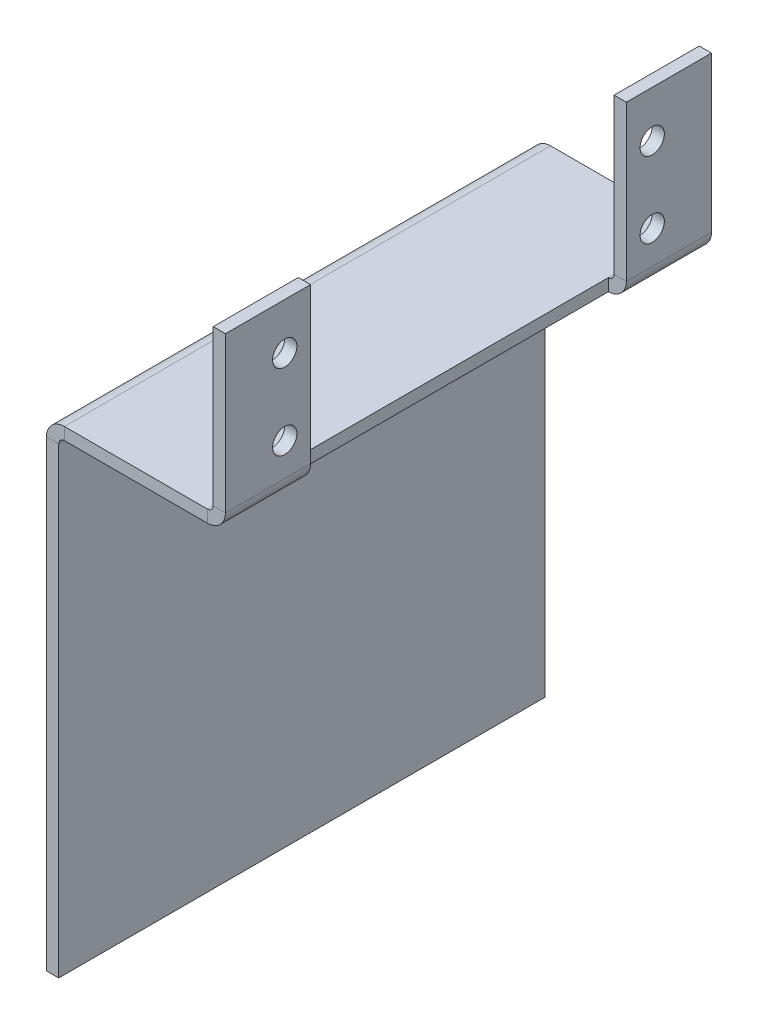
ISO-10303-21;
HEADER;
FILE_DESCRIPTION(('STEP AP214'),'2;1');
FILE_NAME('part.step','',(''),(''),'','','');
FILE_SCHEMA(('AUTOMOTIVE_DESIGN { 1 0 10303 214 1 1 1 1 }'));
ENDSEC;
DATA;
#1=APPLICATION_CONTEXT('core data for automotive mechanical design processes');
#2=APPLICATION_PROTOCOL_DEFINITION('international standard','automotive_design',2000,#1);
#3=PRODUCT_CONTEXT('',#1,'mechanical');
#4=PRODUCT('Part','Part','',(#3));
#5=PRODUCT_RELATED_PRODUCT_CATEGORY('part','',(#4));
#6=PRODUCT_DEFINITION_FORMATION('','',#4);
#7=PRODUCT_DEFINITION_CONTEXT('part definition',#1,'design');
#8=PRODUCT_DEFINITION('design','',#6,#7);
#9=PRODUCT_DEFINITION_SHAPE('','',#8);
#10=(LENGTH_UNIT() NAMED_UNIT(*) SI_UNIT(.MILLI.,.METRE.));
#11=(NAMED_UNIT(*) PLANE_ANGLE_UNIT() SI_UNIT($,.RADIAN.));
#12=(NAMED_UNIT(*) SI_UNIT($,.STERADIAN.) SOLID_ANGLE_UNIT());
#13=UNCERTAINTY_MEASURE_WITH_UNIT(LENGTH_MEASURE(1.E-05),#10,'distance_accuracy_value','');
#14=(GEOMETRIC_REPRESENTATION_CONTEXT(3) GLOBAL_UNCERTAINTY_ASSIGNED_CONTEXT((#13)) GLOBAL_UNIT_ASSIGNED_CONTEXT((#10,
#11,#12)) REPRESENTATION_CONTEXT('',''));
#15=CARTESIAN_POINT('',(0.,0.,0.));
#16=DIRECTION('',(0.,0.,1.));
#17=DIRECTION('',(1.,0.,0.));
#18=AXIS2_PLACEMENT_3D('',#15,#16,#17);
#19=CARTESIAN_POINT('',(-18.6653000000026,0.7366,-38.1));
#20=DIRECTION('',(0.,0.,-1.));
#21=DIRECTION('',(1.,0.,0.));
#22=AXIS2_PLACEMENT_3D('',#19,#20,#21);
#23=CYLINDRICAL_SURFACE('',#22,2.3368);
#24=DIRECTION('',(0.,0.,-1.));
#25=VECTOR('',#24,1.);
#26=CARTESIAN_POINT('',(-18.6653000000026,-1.6002,-38.1));
#27=LINE('',#26,#25);
#28=CARTESIAN_POINT('',(-18.6653000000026,-1.6002,14.28));
#29=VERTEX_POINT('',#28);
#30=CARTESIAN_POINT('',(-18.6653000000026,-1.6002,25.4));
#31=VERTEX_POINT('',#30);
#32=EDGE_CURVE('E403',#29,#31,#27,.F.);
#33=ORIENTED_EDGE('',*,*,#32,.F.);
#34=CARTESIAN_POINT('',(-18.6653000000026,0.736599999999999,14.28));
#35=DIRECTION('',(0.,0.,1.));
#36=DIRECTION('',(1.,0.,0.));
#37=AXIS2_PLACEMENT_3D('',#34,#35,#36);
#38=CIRCLE('',#37,2.3368);
#39=CARTESIAN_POINT('',(-16.3285000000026,0.736600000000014,14.28));
#40=VERTEX_POINT('',#39);
#41=EDGE_CURVE('E455',#29,#40,#38,.T.);
#42=ORIENTED_EDGE('',*,*,#41,.T.);
#43=DIRECTION('',(0.,0.,-1.));
#44=VECTOR('',#43,1.);
#45=CARTESIAN_POINT('',(-16.3285000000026,0.736599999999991,25.4));
#46=LINE('',#45,#44);
#47=CARTESIAN_POINT('',(-16.3285000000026,0.736599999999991,25.4));
#48=VERTEX_POINT('',#47);
#49=EDGE_CURVE('E376',#40,#48,#46,.F.);
#50=ORIENTED_EDGE('',*,*,#49,.T.);
#51=CARTESIAN_POINT('',(-18.6653000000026,0.7366,25.4));
#52=DIRECTION('',(0.,0.,-1.));
#53=DIRECTION('',(-1.,0.,0.));
#54=AXIS2_PLACEMENT_3D('',#51,#52,#53);
#55=CIRCLE('',#54,2.3368);
#56=EDGE_CURVE('E238',#31,#48,#55,.F.);
#57=ORIENTED_EDGE('',*,*,#56,.F.);
#58=EDGE_LOOP('',(#33,#42,#50,#57));
#59=FACE_BOUND('',#58,.T.);
#60=ADVANCED_FACE('F59',(#59),#23,.T.);
#61=CARTESIAN_POINT('',(-16.3285000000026,0.736599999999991,-38.1));
#62=VERTEX_POINT('',#61);
#63=CARTESIAN_POINT('',(-16.3285000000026,0.73659999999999,-26.98));
#64=VERTEX_POINT('',#63);
#65=EDGE_CURVE('E387',#62,#64,#46,.F.);
#66=ORIENTED_EDGE('',*,*,#65,.T.);
#67=CARTESIAN_POINT('',(-18.6653000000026,0.736599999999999,-26.98));
#68=DIRECTION('',(0.,0.,-1.));
#69=DIRECTION('',(-1.,0.,0.));
#70=AXIS2_PLACEMENT_3D('',#67,#68,#69);
#71=CIRCLE('',#70,2.3368);
#72=CARTESIAN_POINT('',(-18.6653000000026,-1.6002,-26.98));
#73=VERTEX_POINT('',#72);
#74=EDGE_CURVE('E207',#64,#73,#71,.T.);
#75=ORIENTED_EDGE('',*,*,#74,.T.);
#76=CARTESIAN_POINT('',(-18.6653000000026,-1.6002,-38.1));
#77=VERTEX_POINT('',#76);
#78=EDGE_CURVE('E400',#77,#73,#27,.F.);
#79=ORIENTED_EDGE('',*,*,#78,.F.);
#80=CARTESIAN_POINT('',(-18.6653000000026,0.7366,-38.1));
#81=DIRECTION('',(0.,0.,-1.));
#82=DIRECTION('',(-1.,0.,0.));
#83=AXIS2_PLACEMENT_3D('',#80,#81,#82);
#84=CIRCLE('',#83,2.3368);
#85=EDGE_CURVE('E226',#62,#77,#84,.T.);
#86=ORIENTED_EDGE('',*,*,#85,.F.);
#87=EDGE_LOOP('',(#66,#75,#79,#86));
#88=FACE_BOUND('',#87,.T.);
#89=ADVANCED_FACE('F338',(#88),#23,.T.);
#90=CARTESIAN_POINT('',(-18.6653000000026,0.7366,-38.1));
#91=DIRECTION('',(0.,0.,-1.));
#92=DIRECTION('',(1.,0.,0.));
#93=AXIS2_PLACEMENT_3D('',#90,#91,#92);
#94=CYLINDRICAL_SURFACE('',#93,0.7366);
#95=CARTESIAN_POINT('',(-18.6653000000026,0.736599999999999,14.28));
#96=DIRECTION('',(0.,0.,1.));
#97=DIRECTION('',(1.,0.,0.));
#98=AXIS2_PLACEMENT_3D('',#95,#96,#97);
#99=CIRCLE('',#98,0.7366);
#100=CARTESIAN_POINT('',(-18.6653000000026,0.,14.28));
#101=VERTEX_POINT('',#100);
#102=CARTESIAN_POINT('',(-17.9287000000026,0.736600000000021,14.28));
#103=VERTEX_POINT('',#102);
#104=EDGE_CURVE('E459',#101,#103,#99,.T.);
#105=ORIENTED_EDGE('',*,*,#104,.F.);
#106=DIRECTION('',(0.,0.,-1.));
#107=VECTOR('',#106,1.);
#108=CARTESIAN_POINT('',(-18.6653000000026,0.,-38.1));
#109=LINE('',#108,#107);
#110=CARTESIAN_POINT('',(-18.6653000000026,0.,25.4));
#111=VERTEX_POINT('',#110);
#112=EDGE_CURVE('E216',#101,#111,#109,.F.);
#113=ORIENTED_EDGE('',*,*,#112,.T.);
#114=CARTESIAN_POINT('',(-18.6653000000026,0.7366,25.4));
#115=DIRECTION('',(0.,0.,-1.));
#116=DIRECTION('',(-1.,0.,0.));
#117=AXIS2_PLACEMENT_3D('',#114,#115,#116);
#118=CIRCLE('',#117,0.7366);
#119=CARTESIAN_POINT('',(-17.9287000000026,0.736599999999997,25.4));
#120=VERTEX_POINT('',#119);
#121=EDGE_CURVE('E223',#111,#120,#118,.F.);
#122=ORIENTED_EDGE('',*,*,#121,.T.);
#123=DIRECTION('',(0.,0.,-1.));
#124=VECTOR('',#123,1.);
#125=CARTESIAN_POINT('',(-17.9287000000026,0.736599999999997,25.4));
#126=LINE('',#125,#124);
#127=EDGE_CURVE('E377',#120,#103,#126,.T.);
#128=ORIENTED_EDGE('',*,*,#127,.T.);
#129=EDGE_LOOP('',(#105,#113,#122,#128));
#130=FACE_BOUND('',#129,.T.);
#131=ADVANCED_FACE('F344',(#130),#94,.F.);
#132=CARTESIAN_POINT('',(-18.6653000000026,0.736599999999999,-26.98));
#133=DIRECTION('',(0.,0.,1.));
#134=DIRECTION('',(1.,0.,0.));
#135=AXIS2_PLACEMENT_3D('',#132,#133,#134);
#136=CIRCLE('',#135,0.7366);
#137=CARTESIAN_POINT('',(-17.9287000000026,0.736600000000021,-26.98));
#138=VERTEX_POINT('',#137);
#139=CARTESIAN_POINT('',(-18.6653000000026,0.,-26.98));
#140=VERTEX_POINT('',#139);
#141=EDGE_CURVE('E200',#138,#140,#136,.F.);
#142=ORIENTED_EDGE('',*,*,#141,.F.);
#143=CARTESIAN_POINT('',(-17.9287000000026,0.736599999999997,-38.1));
#144=VERTEX_POINT('',#143);
#145=EDGE_CURVE('E383',#138,#144,#126,.T.);
#146=ORIENTED_EDGE('',*,*,#145,.T.);
#147=CARTESIAN_POINT('',(-18.6653000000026,0.7366,-38.1));
#148=DIRECTION('',(0.,0.,-1.));
#149=DIRECTION('',(-1.,0.,0.));
#150=AXIS2_PLACEMENT_3D('',#147,#148,#149);
#151=CIRCLE('',#150,0.7366);
#152=CARTESIAN_POINT('',(-18.6653000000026,0.,-38.1));
#153=VERTEX_POINT('',#152);
#154=EDGE_CURVE('E222',#144,#153,#151,.T.);
#155=ORIENTED_EDGE('',*,*,#154,.T.);
#156=EDGE_CURVE('E213',#153,#140,#109,.F.);
#157=ORIENTED_EDGE('',*,*,#156,.T.);
#158=EDGE_LOOP('',(#142,#146,#155,#157));
#159=FACE_BOUND('',#158,.T.);
#160=ADVANCED_FACE('F220',(#159),#94,.F.);
#161=CARTESIAN_POINT('',(-16.3285000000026,0.,0.));
#162=DIRECTION('',(-1.,0.,0.));
#163=DIRECTION('',(0.,-1.,0.));
#164=AXIS2_PLACEMENT_3D('',#161,#162,#163);
#165=PLANE('',#164);
#166=DIRECTION('',(0.,-1.,0.));
#167=VECTOR('',#166,1.);
#168=CARTESIAN_POINT('',(-16.3285000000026,21.0058,14.28));
#169=LINE('',#168,#167);
#170=CARTESIAN_POINT('',(-16.3285000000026,21.0058,14.28));
#171=VERTEX_POINT('',#170);
#172=EDGE_CURVE('E444',#171,#40,#169,.T.);
#173=ORIENTED_EDGE('',*,*,#172,.F.);
#174=DIRECTION('',(0.,0.,1.));
#175=VECTOR('',#174,1.);
#176=CARTESIAN_POINT('',(-16.3285000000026,21.0058,0.));
#177=LINE('',#176,#175);
#178=CARTESIAN_POINT('',(-16.3285000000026,21.0058,25.4));
#179=VERTEX_POINT('',#178);
#180=EDGE_CURVE('E426',#171,#179,#177,.T.);
#181=ORIENTED_EDGE('',*,*,#180,.T.);
#182=DIRECTION('',(0.,-1.,0.));
#183=VECTOR('',#182,1.);
#184=CARTESIAN_POINT('',(-16.3285000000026,0.,25.4));
#185=LINE('',#184,#183);
#186=EDGE_CURVE('E432',#179,#48,#185,.T.);
#187=ORIENTED_EDGE('',*,*,#186,.T.);
#188=ORIENTED_EDGE('',*,*,#49,.F.);
#189=EDGE_LOOP('',(#173,#181,#187,#188));
#190=FACE_BOUND('',#189,.T.);
#191=CARTESIAN_POINT('',(-16.3285000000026,14.9500000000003,17.65));
#192=DIRECTION('',(-1.,0.,0.));
#193=DIRECTION('',(0.,1.,0.));
#194=AXIS2_PLACEMENT_3D('',#191,#192,#193);
#195=CIRCLE('',#194,1.5875);
#196=CARTESIAN_POINT('',(-16.3285000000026,16.5375000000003,17.65));
#197=VERTEX_POINT('',#196);
#198=EDGE_CURVE('E399',#197,#197,#195,.T.);
#199=ORIENTED_EDGE('',*,*,#198,.T.);
#200=EDGE_LOOP('',(#199));
#201=FACE_BOUND('',#200,.T.);
#202=CARTESIAN_POINT('',(-16.3285000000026,5.05000000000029,17.65));
#203=DIRECTION('',(-1.,0.,0.));
#204=DIRECTION('',(0.,1.,0.));
#205=AXIS2_PLACEMENT_3D('',#202,#203,#204);
#206=CIRCLE('',#205,1.5875);
#207=CARTESIAN_POINT('',(-16.3285000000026,6.63750000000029,17.65));
#208=VERTEX_POINT('',#207);
#209=EDGE_CURVE('E468',#208,#208,#206,.T.);
#210=ORIENTED_EDGE('',*,*,#209,.T.);
#211=EDGE_LOOP('',(#210));
#212=FACE_BOUND('',#211,.T.);
#213=ADVANCED_FACE('F506',(#190,#201,#212),#165,.F.);
#214=CARTESIAN_POINT('',(-17.9287000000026,0.,0.));
#215=DIRECTION('',(-1.,0.,0.));
#216=DIRECTION('',(0.,-1.,0.));
#217=AXIS2_PLACEMENT_3D('',#214,#215,#216);
#218=PLANE('',#217);
#219=CARTESIAN_POINT('',(-17.9287000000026,14.9500000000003,17.65));
#220=DIRECTION('',(-1.,0.,0.));
#221=DIRECTION('',(0.,-1.,0.));
#222=AXIS2_PLACEMENT_3D('',#219,#220,#221);
#223=CIRCLE('',#222,1.5875);
#224=CARTESIAN_POINT('',(-17.9287000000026,13.3625000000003,17.65));
#225=VERTEX_POINT('',#224);
#226=EDGE_CURVE('E436',#225,#225,#223,.T.);
#227=ORIENTED_EDGE('',*,*,#226,.F.);
#228=EDGE_LOOP('',(#227));
#229=FACE_BOUND('',#228,.T.);
#230=CARTESIAN_POINT('',(-17.9287000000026,5.05000000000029,17.65));
#231=DIRECTION('',(-1.,0.,0.));
#232=DIRECTION('',(0.,-1.,0.));
#233=AXIS2_PLACEMENT_3D('',#230,#231,#232);
#234=CIRCLE('',#233,1.5875);
#235=CARTESIAN_POINT('',(-17.9287000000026,3.4625000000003,17.65));
#236=VERTEX_POINT('',#235);
#237=EDGE_CURVE('E443',#236,#236,#234,.T.);
#238=ORIENTED_EDGE('',*,*,#237,.F.);
#239=EDGE_LOOP('',(#238));
#240=FACE_BOUND('',#239,.T.);
#241=DIRECTION('',(0.,0.,-1.));
#242=VECTOR('',#241,1.);
#243=CARTESIAN_POINT('',(-17.9287000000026,21.0058,25.4));
#244=LINE('',#243,#242);
#245=CARTESIAN_POINT('',(-17.9287000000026,21.0058,14.28));
#246=VERTEX_POINT('',#245);
#247=CARTESIAN_POINT('',(-17.9287000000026,21.0058,25.4));
#248=VERTEX_POINT('',#247);
#249=EDGE_CURVE('E386',#246,#248,#244,.F.);
#250=ORIENTED_EDGE('',*,*,#249,.F.);
#251=DIRECTION('',(0.,-1.,0.));
#252=VECTOR('',#251,1.);
#253=CARTESIAN_POINT('',(-17.9287000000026,0.,14.28));
#254=LINE('',#253,#252);
#255=EDGE_CURVE('E419',#246,#103,#254,.T.);
#256=ORIENTED_EDGE('',*,*,#255,.T.);
#257=ORIENTED_EDGE('',*,*,#127,.F.);
#258=DIRECTION('',(0.,1.,0.));
#259=VECTOR('',#258,1.);
#260=CARTESIAN_POINT('',(-17.9287000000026,0.,25.4));
#261=LINE('',#260,#259);
#262=EDGE_CURVE('E418',#248,#120,#261,.F.);
#263=ORIENTED_EDGE('',*,*,#262,.F.);
#264=EDGE_LOOP('',(#250,#256,#257,#263));
#265=FACE_BOUND('',#264,.T.);
#266=ADVANCED_FACE('F417',(#229,#240,#265),#218,.T.);
#267=CARTESIAN_POINT('',(-16.3285000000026,21.0058,25.4));
#268=DIRECTION('',(0.,-1.,0.));
#269=DIRECTION('',(1.,0.,0.));
#270=AXIS2_PLACEMENT_3D('',#267,#268,#269);
#271=PLANE('',#270);
#272=DIRECTION('',(1.,0.,0.));
#273=VECTOR('',#272,1.);
#274=CARTESIAN_POINT('',(-16.3285000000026,21.0058,14.28));
#275=LINE('',#274,#273);
#276=EDGE_CURVE('E447',#171,#246,#275,.F.);
#277=ORIENTED_EDGE('',*,*,#276,.T.);
#278=ORIENTED_EDGE('',*,*,#249,.T.);
#279=DIRECTION('',(-1.,0.,0.));
#280=VECTOR('',#279,1.);
#281=CARTESIAN_POINT('',(-16.3285000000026,21.0058,25.4));
#282=LINE('',#281,#280);
#283=EDGE_CURVE('E425',#179,#248,#282,.T.);
#284=ORIENTED_EDGE('',*,*,#283,.F.);
#285=ORIENTED_EDGE('',*,*,#180,.F.);
#286=EDGE_LOOP('',(#277,#278,#284,#285));
#287=FACE_BOUND('',#286,.T.);
#288=ADVANCED_FACE('F510',(#287),#271,.F.);
#289=DIRECTION('',(1.,0.,0.));
#290=VECTOR('',#289,1.);
#291=CARTESIAN_POINT('',(-16.3285000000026,21.0058,-26.98));
#292=LINE('',#291,#290);
#293=CARTESIAN_POINT('',(-16.3285000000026,21.0058,-26.98));
#294=VERTEX_POINT('',#293);
#295=CARTESIAN_POINT('',(-17.9287000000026,21.0058,-26.98));
#296=VERTEX_POINT('',#295);
#297=EDGE_CURVE('E452',#294,#296,#292,.F.);
#298=ORIENTED_EDGE('',*,*,#297,.F.);
#299=CARTESIAN_POINT('',(-16.3285000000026,21.0058,-38.1));
#300=VERTEX_POINT('',#299);
#301=EDGE_CURVE('E429',#300,#294,#177,.T.);
#302=ORIENTED_EDGE('',*,*,#301,.F.);
#303=DIRECTION('',(-1.,0.,0.));
#304=VECTOR('',#303,1.);
#305=CARTESIAN_POINT('',(-16.3285000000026,21.0058,-38.1));
#306=LINE('',#305,#304);
#307=CARTESIAN_POINT('',(-17.9287000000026,21.0058,-38.1));
#308=VERTEX_POINT('',#307);
#309=EDGE_CURVE('E231',#300,#308,#306,.T.);
#310=ORIENTED_EDGE('',*,*,#309,.T.);
#311=EDGE_CURVE('E385',#308,#296,#244,.F.);
#312=ORIENTED_EDGE('',*,*,#311,.T.);
#313=EDGE_LOOP('',(#298,#302,#310,#312));
#314=FACE_BOUND('',#313,.T.);
#315=ADVANCED_FACE('F516',(#314),#271,.F.);
#316=CARTESIAN_POINT('',(-38.1000000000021,-1.6002,-38.1));
#317=DIRECTION('',(0.,0.,-1.));
#318=DIRECTION('',(-1.,0.,0.));
#319=AXIS2_PLACEMENT_3D('',#316,#317,#318);
#320=PLANE('',#319);
#321=DIRECTION('',(-1.,0.,0.));
#322=VECTOR('',#321,1.);
#323=CARTESIAN_POINT('',(-38.1000000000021,0.,-38.1));
#324=LINE('',#323,#322);
#325=CARTESIAN_POINT('',(-37.3634000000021,0.,-38.1));
#326=VERTEX_POINT('',#325);
#327=EDGE_CURVE('E289',#153,#326,#324,.T.);
#328=ORIENTED_EDGE('',*,*,#327,.F.);
#329=DIRECTION('',(0.,-1.,0.));
#330=VECTOR('',#329,1.);
#331=CARTESIAN_POINT('',(-18.6653000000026,0.,-38.1));
#332=LINE('',#331,#330);
#333=EDGE_CURVE('E236',#153,#77,#332,.T.);
#334=ORIENTED_EDGE('',*,*,#333,.T.);
#335=DIRECTION('',(-1.,0.,0.));
#336=VECTOR('',#335,1.);
#337=CARTESIAN_POINT('',(-38.1000000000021,-1.6002,-38.1));
#338=LINE('',#337,#336);
#339=CARTESIAN_POINT('',(-37.3634000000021,-1.6002,-38.1));
#340=VERTEX_POINT('',#339);
#341=EDGE_CURVE('E68',#77,#340,#338,.T.);
#342=ORIENTED_EDGE('',*,*,#341,.T.);
#343=DIRECTION('',(0.,1.,0.));
#344=VECTOR('',#343,1.);
#345=CARTESIAN_POINT('',(-37.3634000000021,-1.60020000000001,-38.1));
#346=LINE('',#345,#344);
#347=EDGE_CURVE('E275',#340,#326,#346,.T.);
#348=ORIENTED_EDGE('',*,*,#347,.T.);
#349=EDGE_LOOP('',(#328,#334,#342,#348));
#350=FACE_BOUND('',#349,.T.);
#351=ADVANCED_FACE('F61',(#350),#320,.T.);
#352=CARTESIAN_POINT('',(0.,-1.6002,0.));
#353=DIRECTION('',(0.,-1.,0.));
#354=DIRECTION('',(0.,0.,-1.));
#355=AXIS2_PLACEMENT_3D('',#352,#353,#354);
#356=PLANE('',#355);
#357=ORIENTED_EDGE('',*,*,#341,.F.);
#358=ORIENTED_EDGE('',*,*,#78,.T.);
#359=DIRECTION('',(0.,0.,-1.));
#360=VECTOR('',#359,1.);
#361=CARTESIAN_POINT('',(-18.6653000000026,-1.6002,-38.1));
#362=LINE('',#361,#360);
#363=EDGE_CURVE('E194',#73,#29,#362,.F.);
#364=ORIENTED_EDGE('',*,*,#363,.T.);
#365=ORIENTED_EDGE('',*,*,#32,.T.);
#366=DIRECTION('',(1.,0.,0.));
#367=VECTOR('',#366,1.);
#368=CARTESIAN_POINT('',(-38.1000000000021,-1.6002,25.4));
#369=LINE('',#368,#367);
#370=CARTESIAN_POINT('',(-37.3634000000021,-1.6002,25.4));
#371=VERTEX_POINT('',#370);
#372=EDGE_CURVE('E13',#371,#31,#369,.T.);
#373=ORIENTED_EDGE('',*,*,#372,.F.);
#374=DIRECTION('',(0.,0.,-1.));
#375=VECTOR('',#374,1.);
#376=CARTESIAN_POINT('',(-37.3634000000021,-1.60020000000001,-38.1));
#377=LINE('',#376,#375);
#378=EDGE_CURVE('E281',#340,#371,#377,.F.);
#379=ORIENTED_EDGE('',*,*,#378,.F.);
#380=EDGE_LOOP('',(#357,#358,#364,#365,#373,#379));
#381=FACE_BOUND('',#380,.T.);
#382=ADVANCED_FACE('F407',(#381),#356,.T.);
#383=CARTESIAN_POINT('',(0.,0.,0.));
#384=DIRECTION('',(0.,-1.,0.));
#385=DIRECTION('',(0.,0.,-1.));
#386=AXIS2_PLACEMENT_3D('',#383,#384,#385);
#387=PLANE('',#386);
#388=ORIENTED_EDGE('',*,*,#156,.F.);
#389=ORIENTED_EDGE('',*,*,#327,.T.);
#390=DIRECTION('',(0.,0.,-1.));
#391=VECTOR('',#390,1.);
#392=CARTESIAN_POINT('',(-37.3634000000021,0.,-38.1));
#393=LINE('',#392,#391);
#394=CARTESIAN_POINT('',(-37.3634000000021,0.,25.4));
#395=VERTEX_POINT('',#394);
#396=EDGE_CURVE('E269',#326,#395,#393,.F.);
#397=ORIENTED_EDGE('',*,*,#396,.T.);
#398=DIRECTION('',(1.,0.,0.));
#399=VECTOR('',#398,1.);
#400=CARTESIAN_POINT('',(-38.1000000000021,0.,25.4));
#401=LINE('',#400,#399);
#402=EDGE_CURVE('E63',#395,#111,#401,.T.);
#403=ORIENTED_EDGE('',*,*,#402,.T.);
#404=ORIENTED_EDGE('',*,*,#112,.F.);
#405=DIRECTION('',(0.,0.,-1.));
#406=VECTOR('',#405,1.);
#407=CARTESIAN_POINT('',(-18.6653000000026,0.,-38.1));
#408=LINE('',#407,#406);
#409=EDGE_CURVE('E191',#140,#101,#408,.F.);
#410=ORIENTED_EDGE('',*,*,#409,.F.);
#411=EDGE_LOOP('',(#388,#389,#397,#403,#404,#410));
#412=FACE_BOUND('',#411,.T.);
#413=ADVANCED_FACE('F212',(#412),#387,.F.);
#414=CARTESIAN_POINT('',(-38.1000000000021,-1.6002,25.4));
#415=DIRECTION('',(0.,0.,1.));
#416=DIRECTION('',(1.,0.,0.));
#417=AXIS2_PLACEMENT_3D('',#414,#415,#416);
#418=PLANE('',#417);
#419=DIRECTION('',(0.,-1.,0.));
#420=VECTOR('',#419,1.);
#421=CARTESIAN_POINT('',(-18.6653000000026,0.,25.4));
#422=LINE('',#421,#420);
#423=EDGE_CURVE('E232',#111,#31,#422,.T.);
#424=ORIENTED_EDGE('',*,*,#423,.F.);
#425=ORIENTED_EDGE('',*,*,#402,.F.);
#426=DIRECTION('',(0.,1.,0.));
#427=VECTOR('',#426,1.);
#428=CARTESIAN_POINT('',(-37.3634000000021,-1.60020000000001,25.4));
#429=LINE('',#428,#427);
#430=EDGE_CURVE('E286',#371,#395,#429,.T.);
#431=ORIENTED_EDGE('',*,*,#430,.F.);
#432=ORIENTED_EDGE('',*,*,#372,.T.);
#433=EDGE_LOOP('',(#424,#425,#431,#432));
#434=FACE_BOUND('',#433,.T.);
#435=ADVANCED_FACE('F295',(#434),#418,.T.);
#436=CARTESIAN_POINT('',(-37.3634000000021,-2.3368,25.4));
#437=DIRECTION('',(0.,0.,1.));
#438=DIRECTION('',(1.,0.,0.));
#439=AXIS2_PLACEMENT_3D('',#436,#437,#438);
#440=PLANE('',#439);
#441=DIRECTION('',(-1.,0.,0.));
#442=VECTOR('',#441,1.);
#443=CARTESIAN_POINT('',(-38.1000000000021,-2.3368,25.4));
#444=LINE('',#443,#442);
#445=CARTESIAN_POINT('',(-38.1000000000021,-2.3368,25.4));
#446=VERTEX_POINT('',#445);
#447=CARTESIAN_POINT('',(-39.7002000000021,-2.33679999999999,25.4));
#448=VERTEX_POINT('',#447);
#449=EDGE_CURVE('E235',#446,#448,#444,.T.);
#450=ORIENTED_EDGE('',*,*,#449,.F.);
#451=CARTESIAN_POINT('',(-37.3634000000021,-2.3368,25.4));
#452=DIRECTION('',(0.,0.,-1.));
#453=DIRECTION('',(-1.,0.,0.));
#454=AXIS2_PLACEMENT_3D('',#451,#452,#453);
#455=CIRCLE('',#454,0.736599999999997);
#456=EDGE_CURVE('E278',#371,#446,#455,.F.);
#457=ORIENTED_EDGE('',*,*,#456,.F.);
#458=ORIENTED_EDGE('',*,*,#430,.T.);
#459=CARTESIAN_POINT('',(-37.3634000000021,-2.3368,25.4));
#460=DIRECTION('',(0.,0.,-1.));
#461=DIRECTION('',(-1.,0.,0.));
#462=AXIS2_PLACEMENT_3D('',#459,#460,#461);
#463=CIRCLE('',#462,2.3368);
#464=EDGE_CURVE('E271',#395,#448,#463,.F.);
#465=ORIENTED_EDGE('',*,*,#464,.T.);
#466=EDGE_LOOP('',(#450,#457,#458,#465));
#467=FACE_BOUND('',#466,.T.);
#468=ADVANCED_FACE('F300',(#467),#440,.T.);
#469=CARTESIAN_POINT('',(-37.3634000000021,-2.3368,-38.1));
#470=DIRECTION('',(0.,0.,1.));
#471=DIRECTION('',(1.,0.,0.));
#472=AXIS2_PLACEMENT_3D('',#469,#470,#471);
#473=PLANE('',#472);
#474=CARTESIAN_POINT('',(-37.3634000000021,-2.3368,-38.1));
#475=DIRECTION('',(0.,0.,-1.));
#476=DIRECTION('',(-1.,0.,0.));
#477=AXIS2_PLACEMENT_3D('',#474,#475,#476);
#478=CIRCLE('',#477,0.736599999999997);
#479=CARTESIAN_POINT('',(-38.1000000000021,-2.3368,-38.1));
#480=VERTEX_POINT('',#479);
#481=EDGE_CURVE('E268',#480,#340,#478,.T.);
#482=ORIENTED_EDGE('',*,*,#481,.F.);
#483=DIRECTION('',(-1.,0.,0.));
#484=VECTOR('',#483,1.);
#485=CARTESIAN_POINT('',(-38.1000000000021,-2.3368,-38.1));
#486=LINE('',#485,#484);
#487=CARTESIAN_POINT('',(-39.7002000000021,-2.33679999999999,-38.1));
#488=VERTEX_POINT('',#487);
#489=EDGE_CURVE('E241',#480,#488,#486,.T.);
#490=ORIENTED_EDGE('',*,*,#489,.T.);
#491=CARTESIAN_POINT('',(-37.3634000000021,-2.3368,-38.1));
#492=DIRECTION('',(0.,0.,-1.));
#493=DIRECTION('',(-1.,0.,0.));
#494=AXIS2_PLACEMENT_3D('',#491,#492,#493);
#495=CIRCLE('',#494,2.3368);
#496=EDGE_CURVE('E272',#488,#326,#495,.T.);
#497=ORIENTED_EDGE('',*,*,#496,.T.);
#498=ORIENTED_EDGE('',*,*,#347,.F.);
#499=EDGE_LOOP('',(#482,#490,#497,#498));
#500=FACE_BOUND('',#499,.T.);
#501=ADVANCED_FACE('F771',(#500),#473,.F.);
#502=CARTESIAN_POINT('',(-37.3634000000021,-2.3368,-38.1));
#503=DIRECTION('',(0.,0.,-1.));
#504=DIRECTION('',(-1.,0.,0.));
#505=AXIS2_PLACEMENT_3D('',#502,#503,#504);
#506=CYLINDRICAL_SURFACE('',#505,2.3368);
#507=ORIENTED_EDGE('',*,*,#396,.F.);
#508=ORIENTED_EDGE('',*,*,#496,.F.);
#509=DIRECTION('',(0.,0.,1.));
#510=VECTOR('',#509,1.);
#511=CARTESIAN_POINT('',(-39.7002000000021,-2.33679999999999,0.));
#512=LINE('',#511,#510);
#513=EDGE_CURVE('E244',#488,#448,#512,.T.);
#514=ORIENTED_EDGE('',*,*,#513,.T.);
#515=ORIENTED_EDGE('',*,*,#464,.F.);
#516=EDGE_LOOP('',(#507,#508,#514,#515));
#517=FACE_BOUND('',#516,.T.);
#518=ADVANCED_FACE('F302',(#517),#506,.T.);
#519=CARTESIAN_POINT('',(-37.3634000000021,-2.3368,-38.1));
#520=DIRECTION('',(0.,0.,-1.));
#521=DIRECTION('',(-1.,0.,0.));
#522=AXIS2_PLACEMENT_3D('',#519,#520,#521);
#523=CYLINDRICAL_SURFACE('',#522,0.736599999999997);
#524=ORIENTED_EDGE('',*,*,#378,.T.);
#525=ORIENTED_EDGE('',*,*,#456,.T.);
#526=DIRECTION('',(0.,0.,-1.));
#527=VECTOR('',#526,1.);
#528=CARTESIAN_POINT('',(-38.1000000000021,-2.3368,25.4));
#529=LINE('',#528,#527);
#530=EDGE_CURVE('E239',#446,#480,#529,.T.);
#531=ORIENTED_EDGE('',*,*,#530,.T.);
#532=ORIENTED_EDGE('',*,*,#481,.T.);
#533=EDGE_LOOP('',(#524,#525,#531,#532));
#534=FACE_BOUND('',#533,.T.);
#535=ADVANCED_FACE('F323',(#534),#523,.F.);
#536=CARTESIAN_POINT('',(-39.7002000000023,-62.7633999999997,-38.1));
#537=DIRECTION('',(0.,0.,1.));
#538=DIRECTION('',(1.,0.,0.));
#539=AXIS2_PLACEMENT_3D('',#536,#537,#538);
#540=PLANE('',#539);
#541=ORIENTED_EDGE('',*,*,#489,.F.);
#542=DIRECTION('',(0.,-1.,0.));
#543=VECTOR('',#542,1.);
#544=CARTESIAN_POINT('',(-38.1000000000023,-62.7633999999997,-38.1));
#545=LINE('',#544,#543);
#546=CARTESIAN_POINT('',(-38.1000000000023,-62.7633999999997,-38.1));
#547=VERTEX_POINT('',#546);
#548=EDGE_CURVE('E248',#480,#547,#545,.T.);
#549=ORIENTED_EDGE('',*,*,#548,.T.);
#550=DIRECTION('',(1.,0.,0.));
#551=VECTOR('',#550,1.);
#552=CARTESIAN_POINT('',(-39.7002000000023,-62.7633999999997,-38.1));
#553=LINE('',#552,#551);
#554=CARTESIAN_POINT('',(-39.7002000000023,-62.7633999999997,-38.1));
#555=VERTEX_POINT('',#554);
#556=EDGE_CURVE('E265',#555,#547,#553,.T.);
#557=ORIENTED_EDGE('',*,*,#556,.F.);
#558=DIRECTION('',(0.,-1.,0.));
#559=VECTOR('',#558,1.);
#560=CARTESIAN_POINT('',(-39.7002000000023,-62.7633999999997,-38.1));
#561=LINE('',#560,#559);
#562=EDGE_CURVE('E249',#488,#555,#561,.T.);
#563=ORIENTED_EDGE('',*,*,#562,.F.);
#564=EDGE_LOOP('',(#541,#549,#557,#563));
#565=FACE_BOUND('',#564,.T.);
#566=ADVANCED_FACE('F312',(#565),#540,.F.);
#567=CARTESIAN_POINT('',(-39.7002000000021,-1.60019999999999,25.4));
#568=DIRECTION('',(0.,0.,-1.));
#569=DIRECTION('',(-1.,0.,0.));
#570=AXIS2_PLACEMENT_3D('',#567,#568,#569);
#571=PLANE('',#570);
#572=ORIENTED_EDGE('',*,*,#449,.T.);
#573=DIRECTION('',(0.,1.,0.));
#574=VECTOR('',#573,1.);
#575=CARTESIAN_POINT('',(-39.7002000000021,-1.60019999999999,25.4));
#576=LINE('',#575,#574);
#577=CARTESIAN_POINT('',(-39.7002000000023,-62.7633999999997,25.4));
#578=VERTEX_POINT('',#577);
#579=EDGE_CURVE('E254',#578,#448,#576,.T.);
#580=ORIENTED_EDGE('',*,*,#579,.F.);
#581=DIRECTION('',(1.,0.,0.));
#582=VECTOR('',#581,1.);
#583=CARTESIAN_POINT('',(-39.7002000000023,-62.7633999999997,25.4));
#584=LINE('',#583,#582);
#585=CARTESIAN_POINT('',(-38.1000000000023,-62.7633999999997,25.4));
#586=VERTEX_POINT('',#585);
#587=EDGE_CURVE('E257',#578,#586,#584,.T.);
#588=ORIENTED_EDGE('',*,*,#587,.T.);
#589=DIRECTION('',(0.,1.,0.));
#590=VECTOR('',#589,1.);
#591=CARTESIAN_POINT('',(-38.1000000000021,-1.6002,25.4));
#592=LINE('',#591,#590);
#593=EDGE_CURVE('E252',#586,#446,#592,.T.);
#594=ORIENTED_EDGE('',*,*,#593,.T.);
#595=EDGE_LOOP('',(#572,#580,#588,#594));
#596=FACE_BOUND('',#595,.T.);
#597=ADVANCED_FACE('F320',(#596),#571,.F.);
#598=CARTESIAN_POINT('',(-39.7002000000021,1.3958148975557E-13,0.));
#599=DIRECTION('',(1.,0.,0.));
#600=DIRECTION('',(0.,1.,0.));
#601=AXIS2_PLACEMENT_3D('',#598,#599,#600);
#602=PLANE('',#601);
#603=ORIENTED_EDGE('',*,*,#513,.F.);
#604=ORIENTED_EDGE('',*,*,#562,.T.);
#605=DIRECTION('',(0.,0.,1.));
#606=VECTOR('',#605,1.);
#607=CARTESIAN_POINT('',(-39.7002000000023,-62.7633999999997,25.4));
#608=LINE('',#607,#606);
#609=EDGE_CURVE('E251',#555,#578,#608,.T.);
#610=ORIENTED_EDGE('',*,*,#609,.T.);
#611=ORIENTED_EDGE('',*,*,#579,.T.);
#612=EDGE_LOOP('',(#603,#604,#610,#611));
#613=FACE_BOUND('',#612,.T.);
#614=ADVANCED_FACE('F306',(#613),#602,.F.);
#615=CARTESIAN_POINT('',(-38.1000000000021,1.33994421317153E-13,0.));
#616=DIRECTION('',(1.,0.,0.));
#617=DIRECTION('',(0.,1.,0.));
#618=AXIS2_PLACEMENT_3D('',#615,#616,#617);
#619=PLANE('',#618);
#620=ORIENTED_EDGE('',*,*,#548,.F.);
#621=ORIENTED_EDGE('',*,*,#530,.F.);
#622=ORIENTED_EDGE('',*,*,#593,.F.);
#623=DIRECTION('',(0.,0.,1.));
#624=VECTOR('',#623,1.);
#625=CARTESIAN_POINT('',(-38.1000000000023,-62.7633999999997,25.4));
#626=LINE('',#625,#624);
#627=EDGE_CURVE('E259',#547,#586,#626,.T.);
#628=ORIENTED_EDGE('',*,*,#627,.F.);
#629=EDGE_LOOP('',(#620,#621,#622,#628));
#630=FACE_BOUND('',#629,.T.);
#631=ADVANCED_FACE('F326',(#630),#619,.T.);
#632=CARTESIAN_POINT('',(-39.7002000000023,-62.7633999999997,25.4));
#633=DIRECTION('',(0.,1.,0.));
#634=DIRECTION('',(-1.,0.,0.));
#635=AXIS2_PLACEMENT_3D('',#632,#633,#634);
#636=PLANE('',#635);
#637=ORIENTED_EDGE('',*,*,#627,.T.);
#638=ORIENTED_EDGE('',*,*,#587,.F.);
#639=ORIENTED_EDGE('',*,*,#609,.F.);
#640=ORIENTED_EDGE('',*,*,#556,.T.);
#641=EDGE_LOOP('',(#637,#638,#639,#640));
#642=FACE_BOUND('',#641,.T.);
#643=ADVANCED_FACE('F316',(#642),#636,.F.);
#644=CARTESIAN_POINT('',(-18.6653000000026,0.7366,25.4));
#645=DIRECTION('',(0.,0.,1.));
#646=DIRECTION('',(1.,0.,0.));
#647=AXIS2_PLACEMENT_3D('',#644,#645,#646);
#648=PLANE('',#647);
#649=DIRECTION('',(-1.,0.,0.));
#650=VECTOR('',#649,1.);
#651=CARTESIAN_POINT('',(-16.3285000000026,0.736599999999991,25.4));
#652=LINE('',#651,#650);
#653=EDGE_CURVE('E396',#120,#48,#652,.F.);
#654=ORIENTED_EDGE('',*,*,#653,.F.);
#655=ORIENTED_EDGE('',*,*,#121,.F.);
#656=ORIENTED_EDGE('',*,*,#423,.T.);
#657=ORIENTED_EDGE('',*,*,#56,.T.);
#658=EDGE_LOOP('',(#654,#655,#656,#657));
#659=FACE_BOUND('',#658,.T.);
#660=ADVANCED_FACE('F333',(#659),#648,.T.);
#661=CARTESIAN_POINT('',(-18.6653000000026,0.7366,-38.1));
#662=DIRECTION('',(0.,0.,1.));
#663=DIRECTION('',(1.,0.,0.));
#664=AXIS2_PLACEMENT_3D('',#661,#662,#663);
#665=PLANE('',#664);
#666=ORIENTED_EDGE('',*,*,#154,.F.);
#667=DIRECTION('',(-1.,0.,0.));
#668=VECTOR('',#667,1.);
#669=CARTESIAN_POINT('',(-17.9287000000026,0.736599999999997,-38.1));
#670=LINE('',#669,#668);
#671=EDGE_CURVE('E368',#144,#62,#670,.F.);
#672=ORIENTED_EDGE('',*,*,#671,.T.);
#673=ORIENTED_EDGE('',*,*,#85,.T.);
#674=ORIENTED_EDGE('',*,*,#333,.F.);
#675=EDGE_LOOP('',(#666,#672,#673,#674));
#676=FACE_BOUND('',#675,.T.);
#677=ADVANCED_FACE('F356',(#676),#665,.F.);
#678=CARTESIAN_POINT('',(-16.3285000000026,21.0058,-38.1));
#679=DIRECTION('',(0.,0.,1.));
#680=DIRECTION('',(1.,0.,0.));
#681=AXIS2_PLACEMENT_3D('',#678,#679,#680);
#682=PLANE('',#681);
#683=ORIENTED_EDGE('',*,*,#671,.F.);
#684=DIRECTION('',(0.,-1.,0.));
#685=VECTOR('',#684,1.);
#686=CARTESIAN_POINT('',(-17.9287000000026,21.0058,-38.1));
#687=LINE('',#686,#685);
#688=EDGE_CURVE('E373',#144,#308,#687,.F.);
#689=ORIENTED_EDGE('',*,*,#688,.T.);
#690=ORIENTED_EDGE('',*,*,#309,.F.);
#691=DIRECTION('',(0.,1.,0.));
#692=VECTOR('',#691,1.);
#693=CARTESIAN_POINT('',(-16.3285000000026,0.,-38.1));
#694=LINE('',#693,#692);
#695=EDGE_CURVE('E375',#62,#300,#694,.T.);
#696=ORIENTED_EDGE('',*,*,#695,.F.);
#697=EDGE_LOOP('',(#683,#689,#690,#696));
#698=FACE_BOUND('',#697,.T.);
#699=ADVANCED_FACE('F349',(#698),#682,.F.);
#700=CARTESIAN_POINT('',(-16.3285000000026,0.,25.4));
#701=DIRECTION('',(0.,0.,-1.));
#702=DIRECTION('',(0.,1.,0.));
#703=AXIS2_PLACEMENT_3D('',#700,#701,#702);
#704=PLANE('',#703);
#705=ORIENTED_EDGE('',*,*,#653,.T.);
#706=ORIENTED_EDGE('',*,*,#186,.F.);
#707=ORIENTED_EDGE('',*,*,#283,.T.);
#708=ORIENTED_EDGE('',*,*,#262,.T.);
#709=EDGE_LOOP('',(#705,#706,#707,#708));
#710=FACE_BOUND('',#709,.T.);
#711=ADVANCED_FACE('F363',(#710),#704,.F.);
#712=DIRECTION('',(0.,1.,0.));
#713=VECTOR('',#712,1.);
#714=CARTESIAN_POINT('',(-16.3285000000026,21.0058,-26.98));
#715=LINE('',#714,#713);
#716=EDGE_CURVE('E76',#64,#294,#715,.T.);
#717=ORIENTED_EDGE('',*,*,#716,.F.);
#718=ORIENTED_EDGE('',*,*,#65,.F.);
#719=ORIENTED_EDGE('',*,*,#695,.T.);
#720=ORIENTED_EDGE('',*,*,#301,.T.);
#721=EDGE_LOOP('',(#717,#718,#719,#720));
#722=FACE_BOUND('',#721,.T.);
#723=CARTESIAN_POINT('',(-16.3285000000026,14.9500000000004,-30.35));
#724=DIRECTION('',(-1.,0.,0.));
#725=DIRECTION('',(0.,1.,0.));
#726=AXIS2_PLACEMENT_3D('',#723,#724,#725);
#727=CIRCLE('',#726,1.5875);
#728=CARTESIAN_POINT('',(-16.3285000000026,16.5375000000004,-30.35));
#729=VERTEX_POINT('',#728);
#730=EDGE_CURVE('E474',#729,#729,#727,.T.);
#731=ORIENTED_EDGE('',*,*,#730,.T.);
#732=EDGE_LOOP('',(#731));
#733=FACE_BOUND('',#732,.T.);
#734=CARTESIAN_POINT('',(-16.3285000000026,5.05000000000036,-30.35));
#735=DIRECTION('',(-1.,0.,0.));
#736=DIRECTION('',(0.,1.,0.));
#737=AXIS2_PLACEMENT_3D('',#734,#735,#736);
#738=CIRCLE('',#737,1.5875);
#739=CARTESIAN_POINT('',(-16.3285000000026,6.63750000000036,-30.35));
#740=VERTEX_POINT('',#739);
#741=EDGE_CURVE('E439',#740,#740,#738,.T.);
#742=ORIENTED_EDGE('',*,*,#741,.T.);
#743=EDGE_LOOP('',(#742));
#744=FACE_BOUND('',#743,.T.);
#745=ADVANCED_FACE('F483',(#722,#733,#744),#165,.F.);
#746=CARTESIAN_POINT('',(-17.9287000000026,14.9500000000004,-30.35));
#747=DIRECTION('',(-1.,0.,0.));
#748=DIRECTION('',(0.,-1.,0.));
#749=AXIS2_PLACEMENT_3D('',#746,#747,#748);
#750=CIRCLE('',#749,1.5875);
#751=CARTESIAN_POINT('',(-17.9287000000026,13.3625000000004,-30.35));
#752=VERTEX_POINT('',#751);
#753=EDGE_CURVE('E471',#752,#752,#750,.T.);
#754=ORIENTED_EDGE('',*,*,#753,.F.);
#755=EDGE_LOOP('',(#754));
#756=FACE_BOUND('',#755,.T.);
#757=CARTESIAN_POINT('',(-17.9287000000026,5.05000000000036,-30.35));
#758=DIRECTION('',(-1.,0.,0.));
#759=DIRECTION('',(0.,-1.,0.));
#760=AXIS2_PLACEMENT_3D('',#757,#758,#759);
#761=CIRCLE('',#760,1.5875);
#762=CARTESIAN_POINT('',(-17.9287000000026,3.46250000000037,-30.35));
#763=VERTEX_POINT('',#762);
#764=EDGE_CURVE('E477',#763,#763,#761,.T.);
#765=ORIENTED_EDGE('',*,*,#764,.F.);
#766=EDGE_LOOP('',(#765));
#767=FACE_BOUND('',#766,.T.);
#768=ORIENTED_EDGE('',*,*,#145,.F.);
#769=DIRECTION('',(0.,-1.,0.));
#770=VECTOR('',#769,1.);
#771=CARTESIAN_POINT('',(-17.9287000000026,0.,-26.98));
#772=LINE('',#771,#770);
#773=EDGE_CURVE('E450',#138,#296,#772,.F.);
#774=ORIENTED_EDGE('',*,*,#773,.T.);
#775=ORIENTED_EDGE('',*,*,#311,.F.);
#776=ORIENTED_EDGE('',*,*,#688,.F.);
#777=EDGE_LOOP('',(#768,#774,#775,#776));
#778=FACE_BOUND('',#777,.T.);
#779=ADVANCED_FACE('F381',(#756,#767,#778),#218,.T.);
#780=CARTESIAN_POINT('',(-16.3285000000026,21.0058,14.28));
#781=DIRECTION('',(0.,0.,-1.));
#782=DIRECTION('',(0.,-1.,0.));
#783=AXIS2_PLACEMENT_3D('',#780,#781,#782);
#784=PLANE('',#783);
#785=ORIENTED_EDGE('',*,*,#276,.F.);
#786=ORIENTED_EDGE('',*,*,#172,.T.);
#787=DIRECTION('',(-1.,0.,0.));
#788=VECTOR('',#787,1.);
#789=CARTESIAN_POINT('',(-16.3285000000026,0.736600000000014,14.28));
#790=LINE('',#789,#788);
#791=EDGE_CURVE('E457',#40,#103,#790,.T.);
#792=ORIENTED_EDGE('',*,*,#791,.T.);
#793=ORIENTED_EDGE('',*,*,#255,.F.);
#794=EDGE_LOOP('',(#785,#786,#792,#793));
#795=FACE_BOUND('',#794,.T.);
#796=ADVANCED_FACE('F494',(#795),#784,.T.);
#797=CARTESIAN_POINT('',(-16.3285000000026,21.0058,-26.98));
#798=DIRECTION('',(0.,0.,1.));
#799=DIRECTION('',(0.,1.,0.));
#800=AXIS2_PLACEMENT_3D('',#797,#798,#799);
#801=PLANE('',#800);
#802=DIRECTION('',(-1.,0.,0.));
#803=VECTOR('',#802,1.);
#804=CARTESIAN_POINT('',(-16.3285000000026,0.736600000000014,-26.98));
#805=LINE('',#804,#803);
#806=EDGE_CURVE('E202',#64,#138,#805,.T.);
#807=ORIENTED_EDGE('',*,*,#806,.F.);
#808=ORIENTED_EDGE('',*,*,#716,.T.);
#809=ORIENTED_EDGE('',*,*,#297,.T.);
#810=ORIENTED_EDGE('',*,*,#773,.F.);
#811=EDGE_LOOP('',(#807,#808,#809,#810));
#812=FACE_BOUND('',#811,.T.);
#813=ADVANCED_FACE('F501',(#812),#801,.T.);
#814=CARTESIAN_POINT('',(-18.6653000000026,0.736599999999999,14.28));
#815=DIRECTION('',(0.,0.,-1.));
#816=DIRECTION('',(-1.,0.,0.));
#817=AXIS2_PLACEMENT_3D('',#814,#815,#816);
#818=PLANE('',#817);
#819=DIRECTION('',(0.,-1.,0.));
#820=VECTOR('',#819,1.);
#821=CARTESIAN_POINT('',(-18.6653000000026,0.,14.28));
#822=LINE('',#821,#820);
#823=EDGE_CURVE('E217',#101,#29,#822,.T.);
#824=ORIENTED_EDGE('',*,*,#823,.F.);
#825=ORIENTED_EDGE('',*,*,#104,.T.);
#826=ORIENTED_EDGE('',*,*,#791,.F.);
#827=ORIENTED_EDGE('',*,*,#41,.F.);
#828=EDGE_LOOP('',(#824,#825,#826,#827));
#829=FACE_BOUND('',#828,.T.);
#830=ADVANCED_FACE('F538',(#829),#818,.T.);
#831=CARTESIAN_POINT('',(-18.6653000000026,0.736599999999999,-26.98));
#832=DIRECTION('',(0.,0.,1.));
#833=DIRECTION('',(1.,0.,0.));
#834=AXIS2_PLACEMENT_3D('',#831,#832,#833);
#835=PLANE('',#834);
#836=ORIENTED_EDGE('',*,*,#806,.T.);
#837=ORIENTED_EDGE('',*,*,#141,.T.);
#838=DIRECTION('',(0.,-1.,0.));
#839=VECTOR('',#838,1.);
#840=CARTESIAN_POINT('',(-18.6653000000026,0.,-26.98));
#841=LINE('',#840,#839);
#842=EDGE_CURVE('E187',#140,#73,#841,.T.);
#843=ORIENTED_EDGE('',*,*,#842,.T.);
#844=ORIENTED_EDGE('',*,*,#74,.F.);
#845=EDGE_LOOP('',(#836,#837,#843,#844));
#846=FACE_BOUND('',#845,.T.);
#847=ADVANCED_FACE('F201',(#846),#835,.T.);
#848=CARTESIAN_POINT('',(-18.6653000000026,0.,-6.34999999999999));
#849=DIRECTION('',(-1.,0.,0.));
#850=DIRECTION('',(0.,0.,-1.));
#851=AXIS2_PLACEMENT_3D('',#848,#849,#850);
#852=PLANE('',#851);
#853=ORIENTED_EDGE('',*,*,#842,.F.);
#854=ORIENTED_EDGE('',*,*,#409,.T.);
#855=ORIENTED_EDGE('',*,*,#823,.T.);
#856=ORIENTED_EDGE('',*,*,#363,.F.);
#857=EDGE_LOOP('',(#853,#854,#855,#856));
#858=FACE_BOUND('',#857,.T.);
#859=ADVANCED_FACE('F189',(#858),#852,.F.);
#860=CARTESIAN_POINT('',(-16.3285000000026,14.9500000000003,17.65));
#861=DIRECTION('',(-1.,0.,0.));
#862=DIRECTION('',(0.,-1.,0.));
#863=AXIS2_PLACEMENT_3D('',#860,#861,#862);
#864=CYLINDRICAL_SURFACE('',#863,1.5875);
#865=ORIENTED_EDGE('',*,*,#198,.F.);
#866=EDGE_LOOP('',(#865));
#867=FACE_BOUND('',#866,.T.);
#868=ORIENTED_EDGE('',*,*,#226,.T.);
#869=EDGE_LOOP('',(#868));
#870=FACE_BOUND('',#869,.T.);
#871=ADVANCED_FACE('F489',(#867,#870),#864,.F.);
#872=CARTESIAN_POINT('',(-16.3285000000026,5.05000000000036,-30.35));
#873=DIRECTION('',(-1.,0.,0.));
#874=DIRECTION('',(0.,-1.,0.));
#875=AXIS2_PLACEMENT_3D('',#872,#873,#874);
#876=CYLINDRICAL_SURFACE('',#875,1.5875);
#877=ORIENTED_EDGE('',*,*,#741,.F.);
#878=EDGE_LOOP('',(#877));
#879=FACE_BOUND('',#878,.T.);
#880=ORIENTED_EDGE('',*,*,#764,.T.);
#881=EDGE_LOOP('',(#880));
#882=FACE_BOUND('',#881,.T.);
#883=ADVANCED_FACE('F485',(#879,#882),#876,.F.);
#884=CARTESIAN_POINT('',(-16.3285000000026,14.9500000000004,-30.35));
#885=DIRECTION('',(-1.,0.,0.));
#886=DIRECTION('',(0.,-1.,0.));
#887=AXIS2_PLACEMENT_3D('',#884,#885,#886);
#888=CYLINDRICAL_SURFACE('',#887,1.5875);
#889=ORIENTED_EDGE('',*,*,#730,.F.);
#890=EDGE_LOOP('',(#889));
#891=FACE_BOUND('',#890,.T.);
#892=ORIENTED_EDGE('',*,*,#753,.T.);
#893=EDGE_LOOP('',(#892));
#894=FACE_BOUND('',#893,.T.);
#895=ADVANCED_FACE('F488',(#891,#894),#888,.F.);
#896=CARTESIAN_POINT('',(-16.3285000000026,5.05000000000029,17.65));
#897=DIRECTION('',(-1.,0.,0.));
#898=DIRECTION('',(0.,-1.,0.));
#899=AXIS2_PLACEMENT_3D('',#896,#897,#898);
#900=CYLINDRICAL_SURFACE('',#899,1.5875);
#901=ORIENTED_EDGE('',*,*,#209,.F.);
#902=EDGE_LOOP('',(#901));
#903=FACE_BOUND('',#902,.T.);
#904=ORIENTED_EDGE('',*,*,#237,.T.);
#905=EDGE_LOOP('',(#904));
#906=FACE_BOUND('',#905,.T.);
#907=ADVANCED_FACE('F523',(#903,#906),#900,.F.);
#908=CLOSED_SHELL('',(#60,#89,#131,#160,#213,#266,#288,#315,#351,#382,#413,#435,#468,#501,#518,
#535,#566,#597,#614,#631,#643,#660,#677,#699,#711,#745,#779,#796,#813,#830,#847,#859,#871,#883,
#895,#907));
#909=MANIFOLD_SOLID_BREP('B2',#908);
#910=ADVANCED_BREP_SHAPE_REPRESENTATION('',(#18,#909),#14);
#911=SHAPE_DEFINITION_REPRESENTATION(#9,#910);
ENDSEC;
END-ISO-10303-21;
